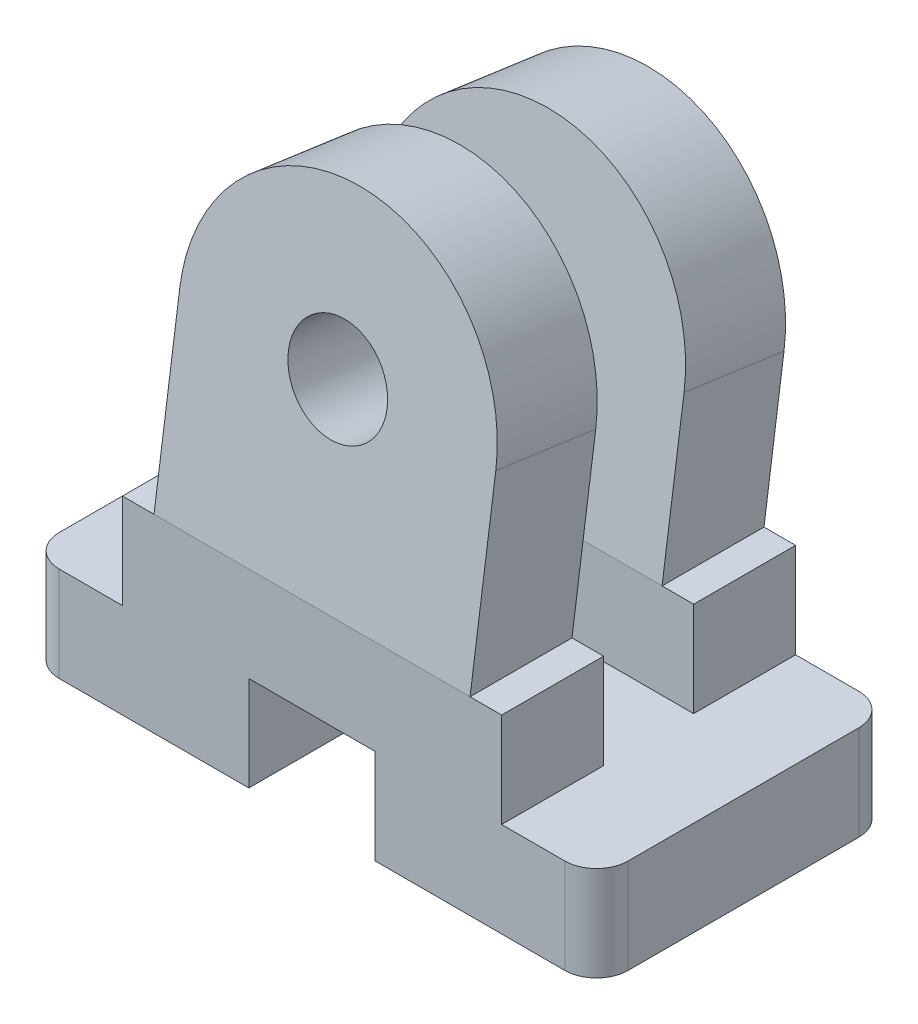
from build123d import *

# Parameters (mm, degrees)
SKETCH1_W              = 18
SKETCH1_H              = 9.3
BASE_DEPTH             = 3
SKETCH2_W              = 12
SKETCH2_H              = 3.225
BASE_MID_DEPTH         = 3
PULLEY_HEAD_DEPTH      = 5
PULLEY_HEAD_DEPTH_BACK = 5
SKETCH4_R              = 1.5625
FRAME_DEPTH            = 22.578698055
SKETCH5_W              = 4
SKETCH5_H              = 9.3
BASE_SLOT_DEPTH        = 3
CORNER_ALLOWANCES_R    = 1


with BuildPart() as part:
    # Sketch1 → Base (new body)
    with BuildSketch(Plane(origin=(0, 0, 0), x_dir=(1, 0, 0), z_dir=(0, 1, 0))):
        Rectangle(SKETCH1_W, SKETCH1_H)
    extrude(amount=BASE_DEPTH)

    # Sketch2 → Base Mid (add)
    with BuildSketch(Plane(origin=(0, 3, 0), x_dir=(1, 0, 0), z_dir=(0, 1, 0))):
        with Locations((0, 3.0375)):
            Rectangle(SKETCH2_W, SKETCH2_H)
        with Locations((0, -3.0375)):
            Rectangle(SKETCH2_W, SKETCH2_H)
    extrude(amount=BASE_MID_DEPTH)

    # Sketch3 → Pulley Head (add, two sides: drawn at the far end of the back side and taken through both)
    with BuildSketch(Plane(origin=(0, 0, 0), x_dir=(0, 0, -1), z_dir=(1, 0, 0)).offset(-PULLEY_HEAD_DEPTH_BACK)):
        Polygon((-3.140601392, 16.739929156), (-4.65, 6), (-1.425, 6), (0.021933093, 16.295463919), align=None)
        Polygon((2.81673101, 15.902680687), (1.425, 6), (4.65, 6), (5.979265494, 15.458215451), align=None)
    extrude(amount=PULLEY_HEAD_DEPTH + PULLEY_HEAD_DEPTH_BACK)

    # Sketch4 → Frame (cut, through all)
    with BuildSketch(Plane(origin=(0, 0.757071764, 5.386845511), x_dir=(1, 0, 0), z_dir=(0, 0.1391731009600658, 0.9902680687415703))):
        with Locations(Location((0, 11.139930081, 0), (0, 0, 270))):
            Circle(SKETCH4_R)
        with BuildLine():
            Line((-5, 11.139930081), (-5, 17.418724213))
            Line((-5, 17.418724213), (5, 17.418724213))
            Line((5, 17.418724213), (5, 11.139930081))
            ThreePointArc((5, 11.139930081), (0, 16.139930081), (-5, 11.139930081))
        make_face()
    extrude(amount=-FRAME_DEPTH, mode=Mode.SUBTRACT)

    # Sketch5 → Base Slot (cut)
    with BuildSketch(Plane.XZ):
        Rectangle(SKETCH5_W, SKETCH5_H)
    extrude(amount=-BASE_SLOT_DEPTH, mode=Mode.SUBTRACT)

    # Corner Allowances
    corner_allowances_edges = [part.edges().sort_by_distance(p)[0] for p in [
        (-9, 1.5, -4.65),
        (-9, 1.5, 4.65),
        (9, 1.5, -4.65),
        (9, 1.5, 4.65),
    ]]
    fillet(corner_allowances_edges, radius=CORNER_ALLOWANCES_R)


solid = part.part
